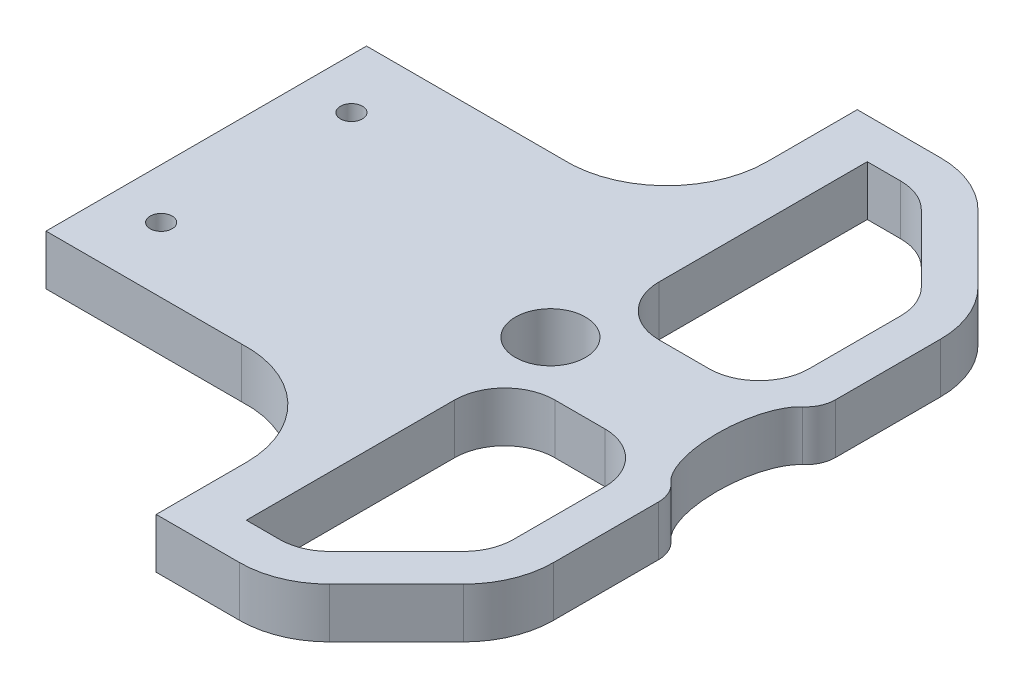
from build123d import *

# Parameters (mm, degrees)
ESQUISSE1_R        = 1.1
ESQUISSE1_R_2      = 3.5
BOSS_EXTRU_1_DEPTH = 5


with BuildPart() as part:
    # Esquisse1 → Boss.-Extru.1 (new body)
    with BuildSketch(Plane(origin=(0, 0, 0), x_dir=(1, 0, 0), z_dir=(0, 1, 0))):
        with BuildLine():
            Line((308, 25.987492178), (308, 35))
            Line((308, 35), (316.328932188, 35))
            ThreePointArc((316.328932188, 35), (319.773083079, 34.314915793), (322.692893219, 32.363961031))
            Line((322.692893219, 32.363961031), (329.363961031, 25.692893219))
            ThreePointArc((329.363961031, 25.692893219), (331.314915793, 22.773083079), (332, 19.328932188))
            Line((332, 19.328932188), (332, 8.837129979))
            ThreePointArc((332, 8.837129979), (331.727538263, 7.587916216), (330.959643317, 6.565611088))
            add(Edge.make_bspline(
                [(330.959643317, 6.565611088), (323.349120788, 0), (330.959643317, -6.565611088)],
                knots=[3.495734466, 3.495734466, 3.495734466, 5.929043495, 5.929043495, 5.929043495], degree=2, weights=[1, 0.346785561, 1]))
            ThreePointArc((330.959643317, -6.565611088), (331.727538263, -7.587916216), (332, -8.837129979))
            Line((332, -8.837129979), (332, -19.328932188))
            ThreePointArc((332, -19.328932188), (331.314915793, -22.773083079), (329.363961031, -25.692893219))
            Line((329.363961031, -25.692893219), (322.692893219, -32.363961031))
            ThreePointArc((322.692893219, -32.363961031), (319.773083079, -34.314915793), (316.328932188, -35))
            Line((316.328932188, -35), (308, -35))
            Line((308, -35), (308, -25.987492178))
            ThreePointArc((308, -25.987492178), (304.892024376, -18.741803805), (297.5, -16))
            Line((297.5, -16), (278, -16))
            Line((278, -16), (278, 16))
            Line((278, 16), (297.5, 16))
            ThreePointArc((297.5, 16), (304.892024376, 18.741803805), (308, 25.987492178))
        make_face()
        with Locations(Location((283, -9.5, 0), (0, 0, 90))):
            Circle(ESQUISSE1_R, mode=Mode.SUBTRACT)
        with Locations(Location((283, 9.5, 0), (0, 0, 270))):
            Circle(ESQUISSE1_R, mode=Mode.SUBTRACT)
        with Locations(Location((312.364466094, 0, 0), (0, 0, 270))):
            Circle(ESQUISSE1_R_2, mode=Mode.SUBTRACT)
        with BuildLine():
            Line((313, 31), (316.328932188, 31))
            ThreePointArc((316.328932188, 31), (318.24234935, 30.619397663), (319.864466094, 29.535533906))
            Line((319.864466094, 29.535533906), (326.535533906, 22.864466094))
            ThreePointArc((326.535533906, 22.864466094), (327.619397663, 21.24234935), (328, 19.328932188))
            Line((328, 19.328932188), (328, 10.2))
            ThreePointArc((328, 10.2), (326.535533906, 6.664466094), (323, 5.2))
            Line((323, 5.2), (318, 5.2))
            ThreePointArc((318, 5.2), (314.464466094, 6.664466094), (313, 10.2))
            Line((313, 10.2), (313, 31))
        make_face(mode=Mode.SUBTRACT)
        with BuildLine():
            Line((323, -5.2), (318, -5.2))
            ThreePointArc((318, -5.2), (314.464466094, -6.664466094), (313, -10.2))
            Line((313, -10.2), (313, -31))
            Line((313, -31), (316.328932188, -31))
            ThreePointArc((316.328932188, -31), (318.24234935, -30.619397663), (319.864466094, -29.535533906))
            Line((319.864466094, -29.535533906), (326.535533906, -22.864466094))
            ThreePointArc((326.535533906, -22.864466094), (327.619397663, -21.24234935), (328, -19.328932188))
            Line((328, -19.328932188), (328, -10.2))
            ThreePointArc((328, -10.2), (326.535533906, -6.664466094), (323, -5.2))
        make_face(mode=Mode.SUBTRACT)
    extrude(amount=BOSS_EXTRU_1_DEPTH)


solid = part.part
